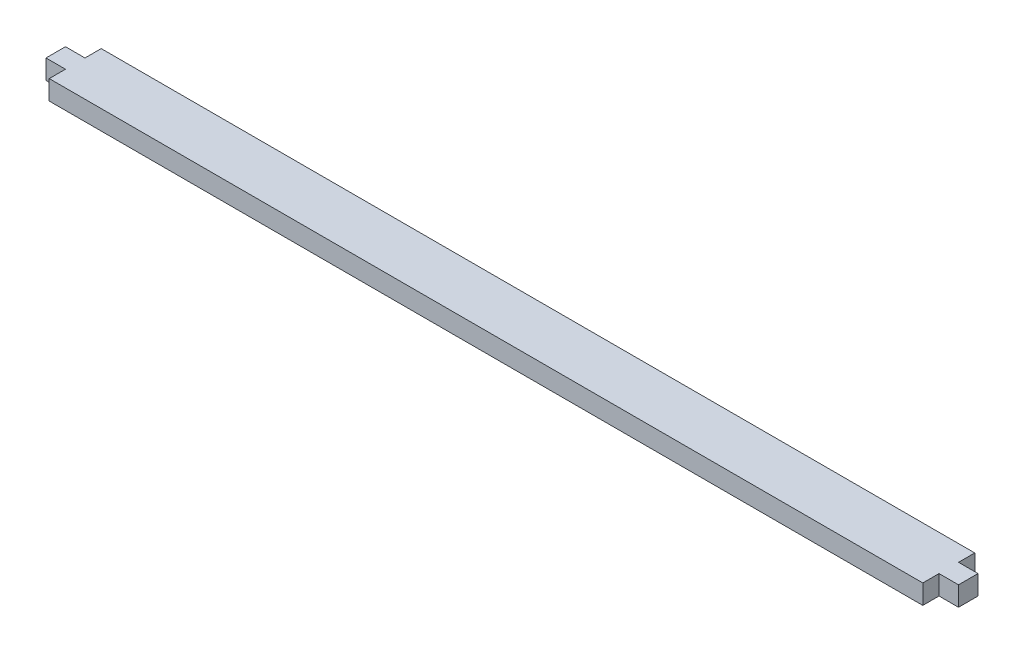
ISO-10303-21;
HEADER;
FILE_DESCRIPTION(('STEP AP214'),'2;1');
FILE_NAME('part.step','',(''),(''),'','','');
FILE_SCHEMA(('AUTOMOTIVE_DESIGN { 1 0 10303 214 1 1 1 1 }'));
ENDSEC;
DATA;
#1=APPLICATION_CONTEXT('core data for automotive mechanical design processes');
#2=APPLICATION_PROTOCOL_DEFINITION('international standard','automotive_design',2000,#1);
#3=PRODUCT_CONTEXT('',#1,'mechanical');
#4=PRODUCT('Part','Part','',(#3));
#5=PRODUCT_RELATED_PRODUCT_CATEGORY('part','',(#4));
#6=PRODUCT_DEFINITION_FORMATION('','',#4);
#7=PRODUCT_DEFINITION_CONTEXT('part definition',#1,'design');
#8=PRODUCT_DEFINITION('design','',#6,#7);
#9=PRODUCT_DEFINITION_SHAPE('','',#8);
#10=(LENGTH_UNIT() NAMED_UNIT(*) SI_UNIT(.MILLI.,.METRE.));
#11=(NAMED_UNIT(*) PLANE_ANGLE_UNIT() SI_UNIT($,.RADIAN.));
#12=(NAMED_UNIT(*) SI_UNIT($,.STERADIAN.) SOLID_ANGLE_UNIT());
#13=UNCERTAINTY_MEASURE_WITH_UNIT(LENGTH_MEASURE(1.E-05),#10,'distance_accuracy_value','');
#14=(GEOMETRIC_REPRESENTATION_CONTEXT(3) GLOBAL_UNCERTAINTY_ASSIGNED_CONTEXT((#13)) GLOBAL_UNIT_ASSIGNED_CONTEXT((#10,
#11,#12)) REPRESENTATION_CONTEXT('',''));
#15=CARTESIAN_POINT('',(0.,0.,0.));
#16=DIRECTION('',(0.,0.,1.));
#17=DIRECTION('',(1.,0.,0.));
#18=AXIS2_PLACEMENT_3D('',#15,#16,#17);
#19=CARTESIAN_POINT('',(70.25,3.,4.));
#20=DIRECTION('',(0.,1.,0.));
#21=DIRECTION('',(0.,0.,1.));
#22=AXIS2_PLACEMENT_3D('',#19,#20,#21);
#23=PLANE('',#22);
#24=DIRECTION('',(1.,0.,0.));
#25=VECTOR('',#24,1.);
#26=CARTESIAN_POINT('',(70.25,3.,-1.5));
#27=LINE('',#26,#25);
#28=CARTESIAN_POINT('',(67.25,3.,-1.5));
#29=VERTEX_POINT('',#28);
#30=CARTESIAN_POINT('',(70.25,3.,-1.5));
#31=VERTEX_POINT('',#30);
#32=EDGE_CURVE('E137',#29,#31,#27,.T.);
#33=ORIENTED_EDGE('',*,*,#32,.F.);
#34=DIRECTION('',(0.,0.,1.));
#35=VECTOR('',#34,1.);
#36=CARTESIAN_POINT('',(67.25,3.,-4.));
#37=LINE('',#36,#35);
#38=CARTESIAN_POINT('',(67.25,3.,-4.));
#39=VERTEX_POINT('',#38);
#40=EDGE_CURVE('E124',#39,#29,#37,.T.);
#41=ORIENTED_EDGE('',*,*,#40,.F.);
#42=DIRECTION('',(-1.,0.,0.));
#43=VECTOR('',#42,1.);
#44=CARTESIAN_POINT('',(-70.25,3.,-4.));
#45=LINE('',#44,#43);
#46=CARTESIAN_POINT('',(-67.25,3.,-4.));
#47=VERTEX_POINT('',#46);
#48=EDGE_CURVE('E134',#39,#47,#45,.T.);
#49=ORIENTED_EDGE('',*,*,#48,.T.);
#50=DIRECTION('',(0.,0.,-1.));
#51=VECTOR('',#50,1.);
#52=CARTESIAN_POINT('',(-67.25,3.,-4.));
#53=LINE('',#52,#51);
#54=CARTESIAN_POINT('',(-67.25,3.,-1.5));
#55=VERTEX_POINT('',#54);
#56=EDGE_CURVE('E209',#55,#47,#53,.T.);
#57=ORIENTED_EDGE('',*,*,#56,.F.);
#58=DIRECTION('',(1.,0.,0.));
#59=VECTOR('',#58,1.);
#60=CARTESIAN_POINT('',(-70.25,3.,-1.5));
#61=LINE('',#60,#59);
#62=CARTESIAN_POINT('',(-70.25,3.,-1.5));
#63=VERTEX_POINT('',#62);
#64=EDGE_CURVE('E207',#63,#55,#61,.T.);
#65=ORIENTED_EDGE('',*,*,#64,.F.);
#66=DIRECTION('',(0.,0.,1.));
#67=VECTOR('',#66,1.);
#68=CARTESIAN_POINT('',(-70.25,3.,-4.));
#69=LINE('',#68,#67);
#70=CARTESIAN_POINT('',(-70.25,3.,1.5));
#71=VERTEX_POINT('',#70);
#72=EDGE_CURVE('E42',#63,#71,#69,.T.);
#73=ORIENTED_EDGE('',*,*,#72,.T.);
#74=DIRECTION('',(-1.,0.,0.));
#75=VECTOR('',#74,1.);
#76=CARTESIAN_POINT('',(-70.25,3.,1.5));
#77=LINE('',#76,#75);
#78=CARTESIAN_POINT('',(-67.25,3.,1.5));
#79=VERTEX_POINT('',#78);
#80=EDGE_CURVE('E196',#79,#71,#77,.T.);
#81=ORIENTED_EDGE('',*,*,#80,.F.);
#82=DIRECTION('',(0.,0.,-1.));
#83=VECTOR('',#82,1.);
#84=CARTESIAN_POINT('',(-67.25,3.,4.));
#85=LINE('',#84,#83);
#86=CARTESIAN_POINT('',(-67.25,3.,4.));
#87=VERTEX_POINT('',#86);
#88=EDGE_CURVE('E194',#87,#79,#85,.T.);
#89=ORIENTED_EDGE('',*,*,#88,.F.);
#90=DIRECTION('',(1.,0.,0.));
#91=VECTOR('',#90,1.);
#92=CARTESIAN_POINT('',(-70.25,3.,4.));
#93=LINE('',#92,#91);
#94=CARTESIAN_POINT('',(67.25,3.,4.));
#95=VERTEX_POINT('',#94);
#96=EDGE_CURVE('E11',#87,#95,#93,.T.);
#97=ORIENTED_EDGE('',*,*,#96,.T.);
#98=DIRECTION('',(0.,0.,1.));
#99=VECTOR('',#98,1.);
#100=CARTESIAN_POINT('',(67.25,3.,4.));
#101=LINE('',#100,#99);
#102=CARTESIAN_POINT('',(67.25,3.,1.5));
#103=VERTEX_POINT('',#102);
#104=EDGE_CURVE('E184',#103,#95,#101,.T.);
#105=ORIENTED_EDGE('',*,*,#104,.F.);
#106=DIRECTION('',(-1.,0.,0.));
#107=VECTOR('',#106,1.);
#108=CARTESIAN_POINT('',(70.25,3.,1.5));
#109=LINE('',#108,#107);
#110=CARTESIAN_POINT('',(70.25,3.,1.5));
#111=VERTEX_POINT('',#110);
#112=EDGE_CURVE('E182',#111,#103,#109,.T.);
#113=ORIENTED_EDGE('',*,*,#112,.F.);
#114=DIRECTION('',(0.,0.,-1.));
#115=VECTOR('',#114,1.);
#116=CARTESIAN_POINT('',(70.25,3.,-4.));
#117=LINE('',#116,#115);
#118=EDGE_CURVE('E144',#111,#31,#117,.T.);
#119=ORIENTED_EDGE('',*,*,#118,.T.);
#120=EDGE_LOOP('',(#33,#41,#49,#57,#65,#73,#81,#89,#97,#105,#113,#119));
#121=FACE_BOUND('',#120,.T.);
#122=ADVANCED_FACE('F33',(#121),#23,.T.);
#123=CARTESIAN_POINT('',(70.25,0.,4.));
#124=DIRECTION('',(0.,1.,0.));
#125=DIRECTION('',(0.,0.,1.));
#126=AXIS2_PLACEMENT_3D('',#123,#124,#125);
#127=PLANE('',#126);
#128=DIRECTION('',(0.,0.,1.));
#129=VECTOR('',#128,1.);
#130=CARTESIAN_POINT('',(67.25,0.,-4.));
#131=LINE('',#130,#129);
#132=CARTESIAN_POINT('',(67.25,0.,-4.));
#133=VERTEX_POINT('',#132);
#134=CARTESIAN_POINT('',(67.25,0.,-1.5));
#135=VERTEX_POINT('',#134);
#136=EDGE_CURVE('E50',#133,#135,#131,.T.);
#137=ORIENTED_EDGE('',*,*,#136,.T.);
#138=DIRECTION('',(1.,0.,0.));
#139=VECTOR('',#138,1.);
#140=CARTESIAN_POINT('',(70.25,0.,-1.5));
#141=LINE('',#140,#139);
#142=CARTESIAN_POINT('',(70.25,0.,-1.5));
#143=VERTEX_POINT('',#142);
#144=EDGE_CURVE('E138',#135,#143,#141,.T.);
#145=ORIENTED_EDGE('',*,*,#144,.T.);
#146=DIRECTION('',(0.,0.,-1.));
#147=VECTOR('',#146,1.);
#148=CARTESIAN_POINT('',(70.25,0.,-4.));
#149=LINE('',#148,#147);
#150=CARTESIAN_POINT('',(70.25,0.,1.5));
#151=VERTEX_POINT('',#150);
#152=EDGE_CURVE('E151',#151,#143,#149,.T.);
#153=ORIENTED_EDGE('',*,*,#152,.F.);
#154=DIRECTION('',(-1.,0.,0.));
#155=VECTOR('',#154,1.);
#156=CARTESIAN_POINT('',(70.25,0.,1.5));
#157=LINE('',#156,#155);
#158=CARTESIAN_POINT('',(67.25,0.,1.5));
#159=VERTEX_POINT('',#158);
#160=EDGE_CURVE('E58',#151,#159,#157,.T.);
#161=ORIENTED_EDGE('',*,*,#160,.T.);
#162=DIRECTION('',(0.,0.,1.));
#163=VECTOR('',#162,1.);
#164=CARTESIAN_POINT('',(67.25,0.,4.));
#165=LINE('',#164,#163);
#166=CARTESIAN_POINT('',(67.25,0.,4.));
#167=VERTEX_POINT('',#166);
#168=EDGE_CURVE('E178',#159,#167,#165,.T.);
#169=ORIENTED_EDGE('',*,*,#168,.T.);
#170=DIRECTION('',(1.,0.,0.));
#171=VECTOR('',#170,1.);
#172=CARTESIAN_POINT('',(-70.25,0.,4.));
#173=LINE('',#172,#171);
#174=CARTESIAN_POINT('',(-67.25,0.,4.));
#175=VERTEX_POINT('',#174);
#176=EDGE_CURVE('E37',#175,#167,#173,.T.);
#177=ORIENTED_EDGE('',*,*,#176,.F.);
#178=DIRECTION('',(0.,0.,-1.));
#179=VECTOR('',#178,1.);
#180=CARTESIAN_POINT('',(-67.25,0.,4.));
#181=LINE('',#180,#179);
#182=CARTESIAN_POINT('',(-67.25,0.,1.5));
#183=VERTEX_POINT('',#182);
#184=EDGE_CURVE('E176',#175,#183,#181,.T.);
#185=ORIENTED_EDGE('',*,*,#184,.T.);
#186=DIRECTION('',(-1.,0.,0.));
#187=VECTOR('',#186,1.);
#188=CARTESIAN_POINT('',(-70.25,0.,1.5));
#189=LINE('',#188,#187);
#190=CARTESIAN_POINT('',(-70.25,0.,1.5));
#191=VERTEX_POINT('',#190);
#192=EDGE_CURVE('E197',#183,#191,#189,.T.);
#193=ORIENTED_EDGE('',*,*,#192,.T.);
#194=DIRECTION('',(0.,0.,1.));
#195=VECTOR('',#194,1.);
#196=CARTESIAN_POINT('',(-70.25,0.,-4.));
#197=LINE('',#196,#195);
#198=CARTESIAN_POINT('',(-70.25,0.,-1.5));
#199=VERTEX_POINT('',#198);
#200=EDGE_CURVE('E156',#199,#191,#197,.T.);
#201=ORIENTED_EDGE('',*,*,#200,.F.);
#202=DIRECTION('',(1.,0.,0.));
#203=VECTOR('',#202,1.);
#204=CARTESIAN_POINT('',(-70.25,0.,-1.5));
#205=LINE('',#204,#203);
#206=CARTESIAN_POINT('',(-67.25,0.,-1.5));
#207=VERTEX_POINT('',#206);
#208=EDGE_CURVE('E206',#199,#207,#205,.T.);
#209=ORIENTED_EDGE('',*,*,#208,.T.);
#210=DIRECTION('',(0.,0.,-1.));
#211=VECTOR('',#210,1.);
#212=CARTESIAN_POINT('',(-67.25,0.,-4.));
#213=LINE('',#212,#211);
#214=CARTESIAN_POINT('',(-67.25,0.,-4.));
#215=VERTEX_POINT('',#214);
#216=EDGE_CURVE('E210',#207,#215,#213,.T.);
#217=ORIENTED_EDGE('',*,*,#216,.T.);
#218=DIRECTION('',(-1.,0.,0.));
#219=VECTOR('',#218,1.);
#220=CARTESIAN_POINT('',(-70.25,0.,-4.));
#221=LINE('',#220,#219);
#222=EDGE_CURVE('E154',#133,#215,#221,.T.);
#223=ORIENTED_EDGE('',*,*,#222,.F.);
#224=EDGE_LOOP('',(#137,#145,#153,#161,#169,#177,#185,#193,#201,#209,#217,#223));
#225=FACE_BOUND('',#224,.T.);
#226=ADVANCED_FACE('F174',(#225),#127,.F.);
#227=CARTESIAN_POINT('',(70.25,3.,-4.));
#228=DIRECTION('',(-1.,0.,0.));
#229=DIRECTION('',(0.,0.,1.));
#230=AXIS2_PLACEMENT_3D('',#227,#228,#229);
#231=PLANE('',#230);
#232=DIRECTION('',(0.,-1.,0.));
#233=VECTOR('',#232,1.);
#234=CARTESIAN_POINT('',(70.25,3.,-1.5));
#235=LINE('',#234,#233);
#236=EDGE_CURVE('E239',#31,#143,#235,.T.);
#237=ORIENTED_EDGE('',*,*,#236,.F.);
#238=ORIENTED_EDGE('',*,*,#118,.F.);
#239=DIRECTION('',(0.,-1.,0.));
#240=VECTOR('',#239,1.);
#241=CARTESIAN_POINT('',(70.25,3.,1.5));
#242=LINE('',#241,#240);
#243=EDGE_CURVE('E192',#111,#151,#242,.T.);
#244=ORIENTED_EDGE('',*,*,#243,.T.);
#245=ORIENTED_EDGE('',*,*,#152,.T.);
#246=EDGE_LOOP('',(#237,#238,#244,#245));
#247=FACE_BOUND('',#246,.T.);
#248=ADVANCED_FACE('F35',(#247),#231,.F.);
#249=CARTESIAN_POINT('',(-70.25,3.,-4.));
#250=DIRECTION('',(0.,0.,1.));
#251=DIRECTION('',(1.,0.,0.));
#252=AXIS2_PLACEMENT_3D('',#249,#250,#251);
#253=PLANE('',#252);
#254=DIRECTION('',(0.,-1.,0.));
#255=VECTOR('',#254,1.);
#256=CARTESIAN_POINT('',(67.25,3.,-4.));
#257=LINE('',#256,#255);
#258=EDGE_CURVE('E121',#39,#133,#257,.T.);
#259=ORIENTED_EDGE('',*,*,#258,.T.);
#260=ORIENTED_EDGE('',*,*,#222,.T.);
#261=DIRECTION('',(0.,-1.,0.));
#262=VECTOR('',#261,1.);
#263=CARTESIAN_POINT('',(-67.25,3.,-4.));
#264=LINE('',#263,#262);
#265=EDGE_CURVE('E143',#47,#215,#264,.T.);
#266=ORIENTED_EDGE('',*,*,#265,.F.);
#267=ORIENTED_EDGE('',*,*,#48,.F.);
#268=EDGE_LOOP('',(#259,#260,#266,#267));
#269=FACE_BOUND('',#268,.T.);
#270=ADVANCED_FACE('F141',(#269),#253,.F.);
#271=CARTESIAN_POINT('',(-70.25,3.,4.));
#272=DIRECTION('',(0.,0.,-1.));
#273=DIRECTION('',(-1.,0.,0.));
#274=AXIS2_PLACEMENT_3D('',#271,#272,#273);
#275=PLANE('',#274);
#276=DIRECTION('',(0.,-1.,0.));
#277=VECTOR('',#276,1.);
#278=CARTESIAN_POINT('',(67.25,3.,4.));
#279=LINE('',#278,#277);
#280=EDGE_CURVE('E169',#95,#167,#279,.T.);
#281=ORIENTED_EDGE('',*,*,#280,.F.);
#282=ORIENTED_EDGE('',*,*,#96,.F.);
#283=DIRECTION('',(0.,-1.,0.));
#284=VECTOR('',#283,1.);
#285=CARTESIAN_POINT('',(-67.25,3.,4.));
#286=LINE('',#285,#284);
#287=EDGE_CURVE('E170',#87,#175,#286,.T.);
#288=ORIENTED_EDGE('',*,*,#287,.T.);
#289=ORIENTED_EDGE('',*,*,#176,.T.);
#290=EDGE_LOOP('',(#281,#282,#288,#289));
#291=FACE_BOUND('',#290,.T.);
#292=ADVANCED_FACE('F167',(#291),#275,.F.);
#293=CARTESIAN_POINT('',(-70.25,3.,-4.));
#294=DIRECTION('',(1.,0.,0.));
#295=DIRECTION('',(0.,0.,-1.));
#296=AXIS2_PLACEMENT_3D('',#293,#294,#295);
#297=PLANE('',#296);
#298=DIRECTION('',(0.,-1.,0.));
#299=VECTOR('',#298,1.);
#300=CARTESIAN_POINT('',(-70.25,3.,1.5));
#301=LINE('',#300,#299);
#302=EDGE_CURVE('E199',#71,#191,#301,.T.);
#303=ORIENTED_EDGE('',*,*,#302,.F.);
#304=ORIENTED_EDGE('',*,*,#72,.F.);
#305=DIRECTION('',(0.,-1.,0.));
#306=VECTOR('',#305,1.);
#307=CARTESIAN_POINT('',(-70.25,3.,-1.5));
#308=LINE('',#307,#306);
#309=EDGE_CURVE('E155',#63,#199,#308,.T.);
#310=ORIENTED_EDGE('',*,*,#309,.T.);
#311=ORIENTED_EDGE('',*,*,#200,.T.);
#312=EDGE_LOOP('',(#303,#304,#310,#311));
#313=FACE_BOUND('',#312,.T.);
#314=ADVANCED_FACE('F219',(#313),#297,.F.);
#315=CARTESIAN_POINT('',(-70.25,3.,-1.5));
#316=DIRECTION('',(0.,0.,-1.));
#317=DIRECTION('',(-1.,0.,0.));
#318=AXIS2_PLACEMENT_3D('',#315,#316,#317);
#319=PLANE('',#318);
#320=ORIENTED_EDGE('',*,*,#208,.F.);
#321=ORIENTED_EDGE('',*,*,#309,.F.);
#322=ORIENTED_EDGE('',*,*,#64,.T.);
#323=DIRECTION('',(0.,-1.,0.));
#324=VECTOR('',#323,1.);
#325=CARTESIAN_POINT('',(-67.25,3.,-1.5));
#326=LINE('',#325,#324);
#327=EDGE_CURVE('E217',#55,#207,#326,.T.);
#328=ORIENTED_EDGE('',*,*,#327,.T.);
#329=EDGE_LOOP('',(#320,#321,#322,#328));
#330=FACE_BOUND('',#329,.T.);
#331=ADVANCED_FACE('F229',(#330),#319,.T.);
#332=CARTESIAN_POINT('',(-67.25,3.,-4.));
#333=DIRECTION('',(-1.,0.,0.));
#334=DIRECTION('',(0.,0.,1.));
#335=AXIS2_PLACEMENT_3D('',#332,#333,#334);
#336=PLANE('',#335);
#337=ORIENTED_EDGE('',*,*,#216,.F.);
#338=ORIENTED_EDGE('',*,*,#327,.F.);
#339=ORIENTED_EDGE('',*,*,#56,.T.);
#340=ORIENTED_EDGE('',*,*,#265,.T.);
#341=EDGE_LOOP('',(#337,#338,#339,#340));
#342=FACE_BOUND('',#341,.T.);
#343=ADVANCED_FACE('F232',(#342),#336,.T.);
#344=CARTESIAN_POINT('',(-67.25,3.,4.));
#345=DIRECTION('',(-1.,0.,0.));
#346=DIRECTION('',(0.,0.,1.));
#347=AXIS2_PLACEMENT_3D('',#344,#345,#346);
#348=PLANE('',#347);
#349=ORIENTED_EDGE('',*,*,#184,.F.);
#350=ORIENTED_EDGE('',*,*,#287,.F.);
#351=ORIENTED_EDGE('',*,*,#88,.T.);
#352=DIRECTION('',(0.,-1.,0.));
#353=VECTOR('',#352,1.);
#354=CARTESIAN_POINT('',(-67.25,3.,1.5));
#355=LINE('',#354,#353);
#356=EDGE_CURVE('E203',#79,#183,#355,.T.);
#357=ORIENTED_EDGE('',*,*,#356,.T.);
#358=EDGE_LOOP('',(#349,#350,#351,#357));
#359=FACE_BOUND('',#358,.T.);
#360=ADVANCED_FACE('F246',(#359),#348,.T.);
#361=CARTESIAN_POINT('',(-70.25,3.,1.5));
#362=DIRECTION('',(0.,0.,1.));
#363=DIRECTION('',(1.,0.,0.));
#364=AXIS2_PLACEMENT_3D('',#361,#362,#363);
#365=PLANE('',#364);
#366=ORIENTED_EDGE('',*,*,#192,.F.);
#367=ORIENTED_EDGE('',*,*,#356,.F.);
#368=ORIENTED_EDGE('',*,*,#80,.T.);
#369=ORIENTED_EDGE('',*,*,#302,.T.);
#370=EDGE_LOOP('',(#366,#367,#368,#369));
#371=FACE_BOUND('',#370,.T.);
#372=ADVANCED_FACE('F225',(#371),#365,.T.);
#373=CARTESIAN_POINT('',(70.25,3.,1.5));
#374=DIRECTION('',(0.,0.,1.));
#375=DIRECTION('',(1.,0.,0.));
#376=AXIS2_PLACEMENT_3D('',#373,#374,#375);
#377=PLANE('',#376);
#378=ORIENTED_EDGE('',*,*,#160,.F.);
#379=ORIENTED_EDGE('',*,*,#243,.F.);
#380=ORIENTED_EDGE('',*,*,#112,.T.);
#381=DIRECTION('',(0.,-1.,0.));
#382=VECTOR('',#381,1.);
#383=CARTESIAN_POINT('',(67.25,3.,1.5));
#384=LINE('',#383,#382);
#385=EDGE_CURVE('E190',#103,#159,#384,.T.);
#386=ORIENTED_EDGE('',*,*,#385,.T.);
#387=EDGE_LOOP('',(#378,#379,#380,#386));
#388=FACE_BOUND('',#387,.T.);
#389=ADVANCED_FACE('F253',(#388),#377,.T.);
#390=CARTESIAN_POINT('',(67.25,3.,4.));
#391=DIRECTION('',(1.,0.,0.));
#392=DIRECTION('',(0.,0.,-1.));
#393=AXIS2_PLACEMENT_3D('',#390,#391,#392);
#394=PLANE('',#393);
#395=ORIENTED_EDGE('',*,*,#168,.F.);
#396=ORIENTED_EDGE('',*,*,#385,.F.);
#397=ORIENTED_EDGE('',*,*,#104,.T.);
#398=ORIENTED_EDGE('',*,*,#280,.T.);
#399=EDGE_LOOP('',(#395,#396,#397,#398));
#400=FACE_BOUND('',#399,.T.);
#401=ADVANCED_FACE('F242',(#400),#394,.T.);
#402=CARTESIAN_POINT('',(67.25,3.,-4.));
#403=DIRECTION('',(1.,0.,0.));
#404=DIRECTION('',(0.,0.,-1.));
#405=AXIS2_PLACEMENT_3D('',#402,#403,#404);
#406=PLANE('',#405);
#407=ORIENTED_EDGE('',*,*,#136,.F.);
#408=ORIENTED_EDGE('',*,*,#258,.F.);
#409=ORIENTED_EDGE('',*,*,#40,.T.);
#410=DIRECTION('',(0.,-1.,0.));
#411=VECTOR('',#410,1.);
#412=CARTESIAN_POINT('',(67.25,3.,-1.5));
#413=LINE('',#412,#411);
#414=EDGE_CURVE('E129',#29,#135,#413,.T.);
#415=ORIENTED_EDGE('',*,*,#414,.T.);
#416=EDGE_LOOP('',(#407,#408,#409,#415));
#417=FACE_BOUND('',#416,.T.);
#418=ADVANCED_FACE('F123',(#417),#406,.T.);
#419=CARTESIAN_POINT('',(70.25,3.,-1.5));
#420=DIRECTION('',(0.,0.,-1.));
#421=DIRECTION('',(-1.,0.,0.));
#422=AXIS2_PLACEMENT_3D('',#419,#420,#421);
#423=PLANE('',#422);
#424=ORIENTED_EDGE('',*,*,#144,.F.);
#425=ORIENTED_EDGE('',*,*,#414,.F.);
#426=ORIENTED_EDGE('',*,*,#32,.T.);
#427=ORIENTED_EDGE('',*,*,#236,.T.);
#428=EDGE_LOOP('',(#424,#425,#426,#427));
#429=FACE_BOUND('',#428,.T.);
#430=ADVANCED_FACE('F276',(#429),#423,.T.);
#431=CLOSED_SHELL('',(#122,#226,#248,#270,#292,#314,#331,#343,#360,#372,#389,#401,#418,#430));
#432=MANIFOLD_SOLID_BREP('B2',#431);
#433=ADVANCED_BREP_SHAPE_REPRESENTATION('',(#18,#432),#14);
#434=SHAPE_DEFINITION_REPRESENTATION(#9,#433);
ENDSEC;
END-ISO-10303-21;
